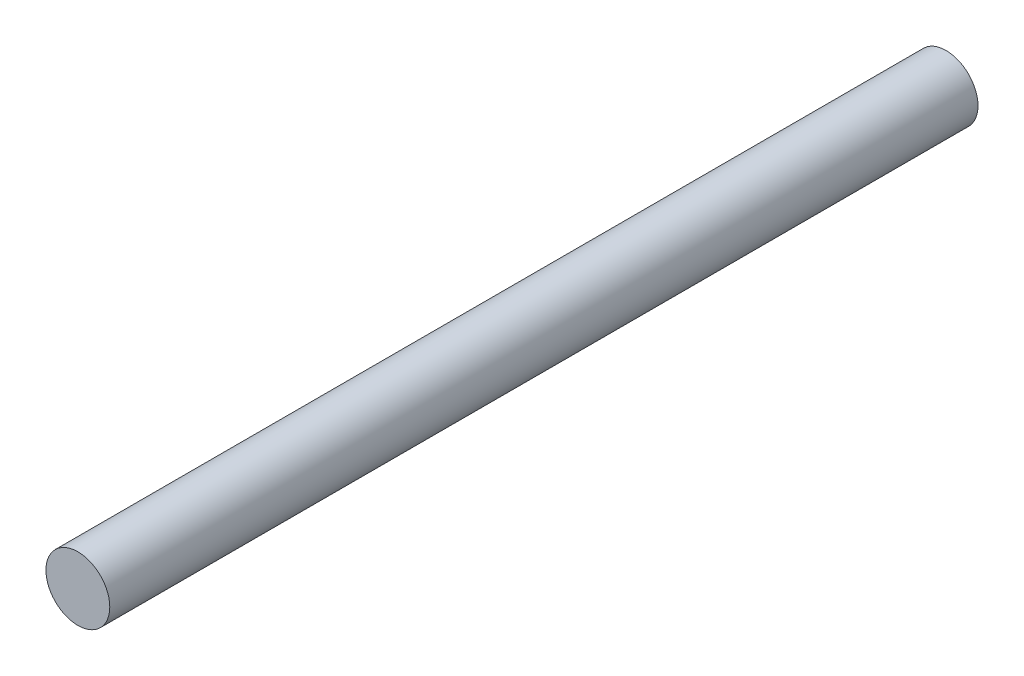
ISO-10303-21;
HEADER;
FILE_DESCRIPTION(('STEP AP214'),'2;1');
FILE_NAME('part.step','',(''),(''),'','','');
FILE_SCHEMA(('AUTOMOTIVE_DESIGN { 1 0 10303 214 1 1 1 1 }'));
ENDSEC;
DATA;
#1=APPLICATION_CONTEXT('core data for automotive mechanical design processes');
#2=APPLICATION_PROTOCOL_DEFINITION('international standard','automotive_design',2000,#1);
#3=PRODUCT_CONTEXT('',#1,'mechanical');
#4=PRODUCT('Part','Part','',(#3));
#5=PRODUCT_RELATED_PRODUCT_CATEGORY('part','',(#4));
#6=PRODUCT_DEFINITION_FORMATION('','',#4);
#7=PRODUCT_DEFINITION_CONTEXT('part definition',#1,'design');
#8=PRODUCT_DEFINITION('design','',#6,#7);
#9=PRODUCT_DEFINITION_SHAPE('','',#8);
#10=(LENGTH_UNIT() NAMED_UNIT(*) SI_UNIT(.MILLI.,.METRE.));
#11=(NAMED_UNIT(*) PLANE_ANGLE_UNIT() SI_UNIT($,.RADIAN.));
#12=(NAMED_UNIT(*) SI_UNIT($,.STERADIAN.) SOLID_ANGLE_UNIT());
#13=UNCERTAINTY_MEASURE_WITH_UNIT(LENGTH_MEASURE(1.E-05),#10,'distance_accuracy_value','');
#14=(GEOMETRIC_REPRESENTATION_CONTEXT(3) GLOBAL_UNCERTAINTY_ASSIGNED_CONTEXT((#13)) GLOBAL_UNIT_ASSIGNED_CONTEXT((#10,
#11,#12)) REPRESENTATION_CONTEXT('',''));
#15=CARTESIAN_POINT('',(0.,0.,0.));
#16=DIRECTION('',(0.,0.,1.));
#17=DIRECTION('',(1.,0.,0.));
#18=AXIS2_PLACEMENT_3D('',#15,#16,#17);
#19=CARTESIAN_POINT('',(0.,0.,40.8));
#20=DIRECTION('',(0.,0.,-1.));
#21=DIRECTION('',(-1.,0.,0.));
#22=AXIS2_PLACEMENT_3D('',#19,#20,#21);
#23=CYLINDRICAL_SURFACE('',#22,1.5);
#24=CARTESIAN_POINT('',(0.,0.,40.8));
#25=DIRECTION('',(0.,0.,1.));
#26=DIRECTION('',(1.,0.,0.));
#27=AXIS2_PLACEMENT_3D('',#24,#25,#26);
#28=CIRCLE('',#27,1.5);
#29=CARTESIAN_POINT('',(1.5,0.,40.8));
#30=VERTEX_POINT('',#29);
#31=EDGE_CURVE('E10',#30,#30,#28,.T.);
#32=ORIENTED_EDGE('',*,*,#31,.F.);
#33=EDGE_LOOP('',(#32));
#34=FACE_BOUND('',#33,.T.);
#35=CARTESIAN_POINT('',(0.,0.,0.));
#36=DIRECTION('',(0.,0.,1.));
#37=DIRECTION('',(1.,0.,0.));
#38=AXIS2_PLACEMENT_3D('',#35,#36,#37);
#39=CIRCLE('',#38,1.5);
#40=CARTESIAN_POINT('',(1.5,0.,0.));
#41=VERTEX_POINT('',#40);
#42=EDGE_CURVE('E37',#41,#41,#39,.T.);
#43=ORIENTED_EDGE('',*,*,#42,.T.);
#44=EDGE_LOOP('',(#43));
#45=FACE_BOUND('',#44,.T.);
#46=ADVANCED_FACE('F34',(#34,#45),#23,.T.);
#47=CARTESIAN_POINT('',(0.,0.,40.8));
#48=DIRECTION('',(0.,0.,1.));
#49=DIRECTION('',(1.,0.,0.));
#50=AXIS2_PLACEMENT_3D('',#47,#48,#49);
#51=PLANE('',#50);
#52=ORIENTED_EDGE('',*,*,#31,.T.);
#53=EDGE_LOOP('',(#52));
#54=FACE_BOUND('',#53,.T.);
#55=ADVANCED_FACE('F49',(#54),#51,.T.);
#56=CARTESIAN_POINT('',(0.,0.,0.));
#57=DIRECTION('',(0.,0.,1.));
#58=DIRECTION('',(1.,0.,0.));
#59=AXIS2_PLACEMENT_3D('',#56,#57,#58);
#60=PLANE('',#59);
#61=ORIENTED_EDGE('',*,*,#42,.F.);
#62=EDGE_LOOP('',(#61));
#63=FACE_BOUND('',#62,.T.);
#64=ADVANCED_FACE('F47',(#63),#60,.F.);
#65=CLOSED_SHELL('',(#46,#55,#64));
#66=MANIFOLD_SOLID_BREP('B2',#65);
#67=ADVANCED_BREP_SHAPE_REPRESENTATION('',(#18,#66),#14);
#68=SHAPE_DEFINITION_REPRESENTATION(#9,#67);
ENDSEC;
END-ISO-10303-21;
